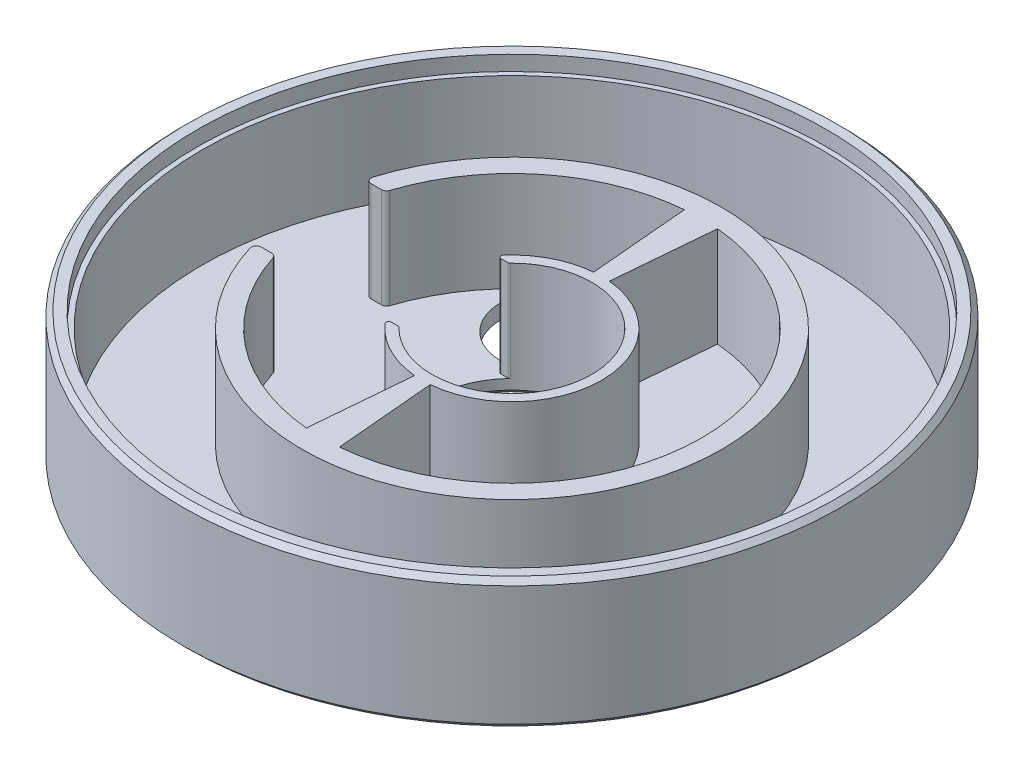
ISO-10303-21;
HEADER;
FILE_DESCRIPTION(('STEP AP214'),'2;1');
FILE_NAME('part.step','',(''),(''),'','','');
FILE_SCHEMA(('AUTOMOTIVE_DESIGN { 1 0 10303 214 1 1 1 1 }'));
ENDSEC;
DATA;
#1=APPLICATION_CONTEXT('core data for automotive mechanical design processes');
#2=APPLICATION_PROTOCOL_DEFINITION('international standard','automotive_design',2000,#1);
#3=PRODUCT_CONTEXT('',#1,'mechanical');
#4=PRODUCT('Part','Part','',(#3));
#5=PRODUCT_RELATED_PRODUCT_CATEGORY('part','',(#4));
#6=PRODUCT_DEFINITION_FORMATION('','',#4);
#7=PRODUCT_DEFINITION_CONTEXT('part definition',#1,'design');
#8=PRODUCT_DEFINITION('design','',#6,#7);
#9=PRODUCT_DEFINITION_SHAPE('','',#8);
#10=(LENGTH_UNIT() NAMED_UNIT(*) SI_UNIT(.MILLI.,.METRE.));
#11=(NAMED_UNIT(*) PLANE_ANGLE_UNIT() SI_UNIT($,.RADIAN.));
#12=(NAMED_UNIT(*) SI_UNIT($,.STERADIAN.) SOLID_ANGLE_UNIT());
#13=UNCERTAINTY_MEASURE_WITH_UNIT(LENGTH_MEASURE(1.E-05),#10,'distance_accuracy_value','');
#14=(GEOMETRIC_REPRESENTATION_CONTEXT(3) GLOBAL_UNCERTAINTY_ASSIGNED_CONTEXT((#13)) GLOBAL_UNIT_ASSIGNED_CONTEXT((#10,
#11,#12)) REPRESENTATION_CONTEXT('',''));
#15=CARTESIAN_POINT('',(0.,0.,0.));
#16=DIRECTION('',(0.,0.,1.));
#17=DIRECTION('',(1.,0.,0.));
#18=AXIS2_PLACEMENT_3D('',#15,#16,#17);
#19=CARTESIAN_POINT('',(-31.,-11.5,0.));
#20=DIRECTION('',(0.,1.,0.));
#21=DIRECTION('',(0.,0.,1.));
#22=AXIS2_PLACEMENT_3D('',#19,#20,#21);
#23=PLANE('',#22);
#24=CARTESIAN_POINT('',(-7.78490417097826,-11.5,-11.6359471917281));
#25=DIRECTION('',(0.,1.,0.));
#26=DIRECTION('',(0.,0.,1.));
#27=AXIS2_PLACEMENT_3D('',#24,#25,#26);
#28=CIRCLE('',#27,5.);
#29=CARTESIAN_POINT('',(-5.00458125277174,-11.5,-7.48025176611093));
#30=VERTEX_POINT('',#29);
#31=CARTESIAN_POINT('',(-10.5652270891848,-11.5,-15.7916426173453));
#32=VERTEX_POINT('',#31);
#33=EDGE_CURVE('E208',#30,#32,#28,.T.);
#34=ORIENTED_EDGE('',*,*,#33,.F.);
#35=CARTESIAN_POINT('',(0.,-11.5,0.));
#36=DIRECTION('',(0.,1.,0.));
#37=DIRECTION('',(0.,0.,1.));
#38=AXIS2_PLACEMENT_3D('',#35,#36,#37);
#39=CIRCLE('',#38,9.00000000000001);
#40=CARTESIAN_POINT('',(-0.784401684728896,-11.5,-8.96575228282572));
#41=VERTEX_POINT('',#40);
#42=EDGE_CURVE('E216',#41,#30,#39,.T.);
#43=ORIENTED_EDGE('',*,*,#42,.F.);
#44=DIRECTION('',(0.0871557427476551,0.,0.996194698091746));
#45=VECTOR('',#44,1.);
#46=CARTESIAN_POINT('',(-1.65595911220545,-11.5,-18.9276992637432));
#47=LINE('',#46,#45);
#48=CARTESIAN_POINT('',(-1.65595911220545,-11.5,-18.9276992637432));
#49=VERTEX_POINT('',#48);
#50=EDGE_CURVE('E246',#49,#41,#47,.T.);
#51=ORIENTED_EDGE('',*,*,#50,.F.);
#52=CARTESIAN_POINT('',(0.,-11.5,0.));
#53=DIRECTION('',(0.,1.,0.));
#54=DIRECTION('',(0.,0.,1.));
#55=AXIS2_PLACEMENT_3D('',#52,#53,#54);
#56=CIRCLE('',#55,19.);
#57=EDGE_CURVE('E219',#49,#32,#56,.T.);
#58=ORIENTED_EDGE('',*,*,#57,.T.);
#59=EDGE_LOOP('',(#34,#43,#51,#58));
#60=FACE_BOUND('',#59,.T.);
#61=ADVANCED_FACE('F34',(#60),#23,.T.);
#62=CARTESIAN_POINT('',(1.65595911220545,-11.5,18.9276992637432));
#63=DIRECTION('',(0.,-1.,0.));
#64=DIRECTION('',(0.,0.,1.));
#65=AXIS2_PLACEMENT_3D('',#62,#63,#64);
#66=PLANE('',#65);
#67=CARTESIAN_POINT('',(14.,-11.5,0.));
#68=DIRECTION('',(0.,1.,0.));
#69=DIRECTION('',(0.,0.,1.));
#70=AXIS2_PLACEMENT_3D('',#67,#68,#69);
#71=CIRCLE('',#70,5.);
#72=CARTESIAN_POINT('',(19.,-11.5,0.));
#73=VERTEX_POINT('',#72);
#74=CARTESIAN_POINT('',(9.00000000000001,-11.5,0.));
#75=VERTEX_POINT('',#74);
#76=EDGE_CURVE('E304',#73,#75,#71,.T.);
#77=ORIENTED_EDGE('',*,*,#76,.F.);
#78=CARTESIAN_POINT('',(0.,-11.5,0.));
#79=DIRECTION('',(0.,1.,0.));
#80=DIRECTION('',(0.,0.,-1.));
#81=AXIS2_PLACEMENT_3D('',#78,#79,#80);
#82=CIRCLE('',#81,19.);
#83=CARTESIAN_POINT('',(1.65595911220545,-11.5,-18.9276992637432));
#84=VERTEX_POINT('',#83);
#85=EDGE_CURVE('E263',#73,#84,#82,.T.);
#86=ORIENTED_EDGE('',*,*,#85,.T.);
#87=DIRECTION('',(-0.087155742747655,0.,0.996194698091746));
#88=VECTOR('',#87,1.);
#89=CARTESIAN_POINT('',(1.65595911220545,-11.5,-18.9276992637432));
#90=LINE('',#89,#88);
#91=CARTESIAN_POINT('',(0.784401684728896,-11.5,-8.96575228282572));
#92=VERTEX_POINT('',#91);
#93=EDGE_CURVE('E279',#84,#92,#90,.T.);
#94=ORIENTED_EDGE('',*,*,#93,.T.);
#95=CARTESIAN_POINT('',(0.,-11.5,0.));
#96=DIRECTION('',(0.,1.,0.));
#97=DIRECTION('',(0.,0.,-1.));
#98=AXIS2_PLACEMENT_3D('',#95,#96,#97);
#99=CIRCLE('',#98,9.00000000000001);
#100=EDGE_CURVE('E267',#75,#92,#99,.T.);
#101=ORIENTED_EDGE('',*,*,#100,.F.);
#102=EDGE_LOOP('',(#77,#86,#94,#101));
#103=FACE_BOUND('',#102,.T.);
#104=ADVANCED_FACE('F320',(#103),#66,.F.);
#105=EDGE_CURVE('E306',#75,#73,#71,.T.);
#106=ORIENTED_EDGE('',*,*,#105,.F.);
#107=CARTESIAN_POINT('',(0.784401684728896,-11.5,8.96575228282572));
#108=VERTEX_POINT('',#107);
#109=EDGE_CURVE('E264',#108,#75,#99,.T.);
#110=ORIENTED_EDGE('',*,*,#109,.F.);
#111=DIRECTION('',(-0.0871557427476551,0.,-0.996194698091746));
#112=VECTOR('',#111,1.);
#113=CARTESIAN_POINT('',(1.65595911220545,-11.5,18.9276992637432));
#114=LINE('',#113,#112);
#115=CARTESIAN_POINT('',(1.65595911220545,-11.5,18.9276992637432));
#116=VERTEX_POINT('',#115);
#117=EDGE_CURVE('E271',#116,#108,#114,.T.);
#118=ORIENTED_EDGE('',*,*,#117,.F.);
#119=EDGE_CURVE('E260',#116,#73,#82,.T.);
#120=ORIENTED_EDGE('',*,*,#119,.T.);
#121=EDGE_LOOP('',(#106,#110,#118,#120));
#122=FACE_BOUND('',#121,.T.);
#123=ADVANCED_FACE('F328',(#122),#66,.F.);
#124=CARTESIAN_POINT('',(0.,-13.,0.));
#125=DIRECTION('',(0.,1.,0.));
#126=DIRECTION('',(0.,0.,1.));
#127=AXIS2_PLACEMENT_3D('',#124,#125,#126);
#128=CYLINDRICAL_SURFACE('',#127,19.);
#129=CARTESIAN_POINT('',(-18.0782323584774,-11.5,5.84615384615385));
#130=VERTEX_POINT('',#129);
#131=CARTESIAN_POINT('',(-1.65595911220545,-11.5,18.9276992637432));
#132=VERTEX_POINT('',#131);
#133=EDGE_CURVE('E237',#130,#132,#56,.T.);
#134=ORIENTED_EDGE('',*,*,#133,.F.);
#135=DIRECTION('',(0.,1.,0.));
#136=VECTOR('',#135,1.);
#137=CARTESIAN_POINT('',(-18.0782323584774,-13.,5.84615384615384));
#138=LINE('',#137,#136);
#139=CARTESIAN_POINT('',(-18.0782323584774,-1.5,5.84615384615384));
#140=VERTEX_POINT('',#139);
#141=EDGE_CURVE('E419',#130,#140,#138,.T.);
#142=ORIENTED_EDGE('',*,*,#141,.T.);
#143=CARTESIAN_POINT('',(0.,-1.5,0.));
#144=DIRECTION('',(0.,1.,0.));
#145=DIRECTION('',(0.,0.,1.));
#146=AXIS2_PLACEMENT_3D('',#143,#144,#145);
#147=CIRCLE('',#146,19.);
#148=CARTESIAN_POINT('',(-1.65595911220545,-1.5,18.9276992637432));
#149=VERTEX_POINT('',#148);
#150=EDGE_CURVE('E463',#140,#149,#147,.T.);
#151=ORIENTED_EDGE('',*,*,#150,.T.);
#152=DIRECTION('',(0.,-1.,0.));
#153=VECTOR('',#152,1.);
#154=CARTESIAN_POINT('',(-1.65595911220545,0.,18.9276992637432));
#155=LINE('',#154,#153);
#156=EDGE_CURVE('E257',#149,#132,#155,.T.);
#157=ORIENTED_EDGE('',*,*,#156,.T.);
#158=EDGE_LOOP('',(#134,#142,#151,#157));
#159=FACE_BOUND('',#158,.T.);
#160=ADVANCED_FACE('F529',(#159),#128,.F.);
#161=CARTESIAN_POINT('',(0.,-13.,0.));
#162=DIRECTION('',(0.,1.,0.));
#163=DIRECTION('',(0.,0.,1.));
#164=AXIS2_PLACEMENT_3D('',#161,#162,#163);
#165=CYLINDRICAL_SURFACE('',#164,9.00000000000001);
#166=CARTESIAN_POINT('',(0.,-1.5,0.));
#167=DIRECTION('',(0.,1.,0.));
#168=DIRECTION('',(0.,0.,1.));
#169=AXIS2_PLACEMENT_3D('',#166,#167,#168);
#170=CIRCLE('',#169,9.00000000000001);
#171=CARTESIAN_POINT('',(-0.784401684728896,-1.5,8.96575228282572));
#172=VERTEX_POINT('',#171);
#173=CARTESIAN_POINT('',(-6.78389449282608,-1.5,5.91428571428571));
#174=VERTEX_POINT('',#173);
#175=EDGE_CURVE('E465',#172,#174,#170,.F.);
#176=ORIENTED_EDGE('',*,*,#175,.T.);
#177=DIRECTION('',(0.,1.,0.));
#178=VECTOR('',#177,1.);
#179=CARTESIAN_POINT('',(-6.78389449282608,-13.,5.91428571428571));
#180=LINE('',#179,#178);
#181=CARTESIAN_POINT('',(-6.78389449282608,-11.5,5.91428571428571));
#182=VERTEX_POINT('',#181);
#183=EDGE_CURVE('E384',#174,#182,#180,.F.);
#184=ORIENTED_EDGE('',*,*,#183,.T.);
#185=CARTESIAN_POINT('',(-0.784401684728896,-11.5,8.96575228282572));
#186=VERTEX_POINT('',#185);
#187=EDGE_CURVE('E231',#182,#186,#39,.T.);
#188=ORIENTED_EDGE('',*,*,#187,.T.);
#189=DIRECTION('',(0.,1.,0.));
#190=VECTOR('',#189,1.);
#191=CARTESIAN_POINT('',(-0.784401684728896,-11.5,8.96575228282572));
#192=LINE('',#191,#190);
#193=EDGE_CURVE('E253',#186,#172,#192,.T.);
#194=ORIENTED_EDGE('',*,*,#193,.T.);
#195=EDGE_LOOP('',(#176,#184,#188,#194));
#196=FACE_BOUND('',#195,.T.);
#197=ADVANCED_FACE('F519',(#196),#165,.T.);
#198=CARTESIAN_POINT('',(0.,-1.5,0.));
#199=DIRECTION('',(0.,1.,0.));
#200=DIRECTION('',(0.,0.,1.));
#201=AXIS2_PLACEMENT_3D('',#198,#199,#200);
#202=PLANE('',#201);
#203=DIRECTION('',(1.,0.,0.));
#204=VECTOR('',#203,1.);
#205=CARTESIAN_POINT('',(0.,-1.5,5.5));
#206=LINE('',#205,#204);
#207=CARTESIAN_POINT('',(-19.6022957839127,-1.5,5.5));
#208=VERTEX_POINT('',#207);
#209=CARTESIAN_POINT('',(-18.5539753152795,-1.5,5.5));
#210=VERTEX_POINT('',#209);
#211=EDGE_CURVE('E285',#208,#210,#206,.T.);
#212=ORIENTED_EDGE('',*,*,#211,.F.);
#213=CARTESIAN_POINT('',(-19.6022957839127,-1.5,6.));
#214=DIRECTION('',(0.,1.,0.));
#215=DIRECTION('',(0.,0.,1.));
#216=AXIS2_PLACEMENT_3D('',#213,#214,#215);
#217=CIRCLE('',#216,0.5);
#218=CARTESIAN_POINT('',(-20.08040055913,-1.5,6.14634146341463));
#219=VERTEX_POINT('',#218);
#220=EDGE_CURVE('E413',#208,#219,#217,.T.);
#221=ORIENTED_EDGE('',*,*,#220,.T.);
#222=CARTESIAN_POINT('',(0.,-1.5,0.));
#223=DIRECTION('',(0.,1.,0.));
#224=DIRECTION('',(0.,0.,1.));
#225=AXIS2_PLACEMENT_3D('',#222,#223,#224);
#226=CIRCLE('',#225,21.);
#227=CARTESIAN_POINT('',(-20.08040055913,-1.5,-6.14634146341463));
#228=VERTEX_POINT('',#227);
#229=EDGE_CURVE('E454',#219,#228,#226,.T.);
#230=ORIENTED_EDGE('',*,*,#229,.T.);
#231=CARTESIAN_POINT('',(-19.6022957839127,-1.5,-6.));
#232=DIRECTION('',(0.,1.,0.));
#233=DIRECTION('',(0.,0.,1.));
#234=AXIS2_PLACEMENT_3D('',#231,#232,#233);
#235=CIRCLE('',#234,0.5);
#236=CARTESIAN_POINT('',(-19.6022957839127,-1.5,-5.5));
#237=VERTEX_POINT('',#236);
#238=EDGE_CURVE('E409',#228,#237,#235,.T.);
#239=ORIENTED_EDGE('',*,*,#238,.T.);
#240=DIRECTION('',(-1.,0.,0.));
#241=VECTOR('',#240,1.);
#242=CARTESIAN_POINT('',(0.,-1.5,-5.5));
#243=LINE('',#242,#241);
#244=CARTESIAN_POINT('',(-18.5539753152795,-1.5,-5.5));
#245=VERTEX_POINT('',#244);
#246=EDGE_CURVE('E289',#245,#237,#243,.T.);
#247=ORIENTED_EDGE('',*,*,#246,.F.);
#248=CARTESIAN_POINT('',(-18.5539753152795,-1.5,-6.));
#249=DIRECTION('',(0.,1.,0.));
#250=DIRECTION('',(0.,0.,1.));
#251=AXIS2_PLACEMENT_3D('',#248,#249,#250);
#252=CIRCLE('',#251,0.5);
#253=CARTESIAN_POINT('',(-18.0782323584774,-1.5,-5.84615384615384));
#254=VERTEX_POINT('',#253);
#255=EDGE_CURVE('E407',#245,#254,#252,.T.);
#256=ORIENTED_EDGE('',*,*,#255,.T.);
#257=CARTESIAN_POINT('',(-1.65595911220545,-1.5,-18.9276992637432));
#258=VERTEX_POINT('',#257);
#259=EDGE_CURVE('E459',#258,#254,#147,.T.);
#260=ORIENTED_EDGE('',*,*,#259,.F.);
#261=DIRECTION('',(0.087155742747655,0.,0.996194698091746));
#262=VECTOR('',#261,1.);
#263=CARTESIAN_POINT('',(0.,-1.5,0.));
#264=LINE('',#263,#262);
#265=CARTESIAN_POINT('',(-0.784401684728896,-1.5,-8.96575228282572));
#266=VERTEX_POINT('',#265);
#267=EDGE_CURVE('E345',#258,#266,#264,.T.);
#268=ORIENTED_EDGE('',*,*,#267,.T.);
#269=CARTESIAN_POINT('',(-6.78389449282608,-1.5,-5.91428571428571));
#270=VERTEX_POINT('',#269);
#271=EDGE_CURVE('E469',#270,#266,#170,.F.);
#272=ORIENTED_EDGE('',*,*,#271,.F.);
#273=CARTESIAN_POINT('',(-6.59545297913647,-1.5,-5.75));
#274=DIRECTION('',(0.,1.,0.));
#275=DIRECTION('',(0.,0.,1.));
#276=AXIS2_PLACEMENT_3D('',#273,#274,#275);
#277=CIRCLE('',#276,0.25);
#278=CARTESIAN_POINT('',(-6.59545297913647,-1.5,-5.5));
#279=VERTEX_POINT('',#278);
#280=EDGE_CURVE('E372',#270,#279,#277,.T.);
#281=ORIENTED_EDGE('',*,*,#280,.T.);
#282=CARTESIAN_POINT('',(-5.91607978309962,-1.5,-5.5));
#283=VERTEX_POINT('',#282);
#284=EDGE_CURVE('E290',#283,#279,#243,.T.);
#285=ORIENTED_EDGE('',*,*,#284,.F.);
#286=CARTESIAN_POINT('',(-5.91607978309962,-1.5,-5.75));
#287=DIRECTION('',(0.,1.,0.));
#288=DIRECTION('',(0.,0.,1.));
#289=AXIS2_PLACEMENT_3D('',#286,#287,#288);
#290=CIRCLE('',#289,0.25);
#291=CARTESIAN_POINT('',(-5.7368046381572,-1.5,-5.57575757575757));
#292=VERTEX_POINT('',#291);
#293=EDGE_CURVE('E370',#283,#292,#290,.T.);
#294=ORIENTED_EDGE('',*,*,#293,.T.);
#295=CARTESIAN_POINT('',(0.,-1.5,0.));
#296=DIRECTION('',(0.,1.,0.));
#297=DIRECTION('',(0.,0.,1.));
#298=AXIS2_PLACEMENT_3D('',#295,#296,#297);
#299=CIRCLE('',#298,8.);
#300=CARTESIAN_POINT('',(-5.7368046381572,-1.5,5.57575757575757));
#301=VERTEX_POINT('',#300);
#302=EDGE_CURVE('E472',#292,#301,#299,.F.);
#303=ORIENTED_EDGE('',*,*,#302,.T.);
#304=CARTESIAN_POINT('',(-5.91607978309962,-1.5,5.75));
#305=DIRECTION('',(0.,1.,0.));
#306=DIRECTION('',(0.,0.,1.));
#307=AXIS2_PLACEMENT_3D('',#304,#305,#306);
#308=CIRCLE('',#307,0.25);
#309=CARTESIAN_POINT('',(-5.91607978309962,-1.5,5.5));
#310=VERTEX_POINT('',#309);
#311=EDGE_CURVE('E390',#301,#310,#308,.T.);
#312=ORIENTED_EDGE('',*,*,#311,.T.);
#313=CARTESIAN_POINT('',(-6.59545297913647,-1.5,5.5));
#314=VERTEX_POINT('',#313);
#315=EDGE_CURVE('E286',#314,#310,#206,.T.);
#316=ORIENTED_EDGE('',*,*,#315,.F.);
#317=CARTESIAN_POINT('',(-6.59545297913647,-1.5,5.75));
#318=DIRECTION('',(0.,1.,0.));
#319=DIRECTION('',(0.,0.,1.));
#320=AXIS2_PLACEMENT_3D('',#317,#318,#319);
#321=CIRCLE('',#320,0.25);
#322=EDGE_CURVE('E392',#314,#174,#321,.T.);
#323=ORIENTED_EDGE('',*,*,#322,.T.);
#324=ORIENTED_EDGE('',*,*,#175,.F.);
#325=DIRECTION('',(0.087155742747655,0.,-0.996194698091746));
#326=VECTOR('',#325,1.);
#327=CARTESIAN_POINT('',(0.,-1.5,0.));
#328=LINE('',#327,#326);
#329=EDGE_CURVE('E470',#149,#172,#328,.T.);
#330=ORIENTED_EDGE('',*,*,#329,.F.);
#331=ORIENTED_EDGE('',*,*,#150,.F.);
#332=CARTESIAN_POINT('',(-18.5539753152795,-1.5,6.));
#333=DIRECTION('',(0.,1.,0.));
#334=DIRECTION('',(0.,0.,1.));
#335=AXIS2_PLACEMENT_3D('',#332,#333,#334);
#336=CIRCLE('',#335,0.5);
#337=EDGE_CURVE('E411',#140,#210,#336,.T.);
#338=ORIENTED_EDGE('',*,*,#337,.T.);
#339=EDGE_LOOP('',(#212,#221,#230,#239,#247,#256,#260,#268,#272,#281,#285,#294,#303,#312,#316,
#323,#324,#330,#331,#338));
#340=FACE_BOUND('',#339,.T.);
#341=CARTESIAN_POINT('',(0.,-1.5,0.));
#342=DIRECTION('',(0.,1.,0.));
#343=DIRECTION('',(0.,0.,1.));
#344=AXIS2_PLACEMENT_3D('',#341,#342,#343);
#345=CIRCLE('',#344,19.);
#346=CARTESIAN_POINT('',(1.65595911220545,-1.5,18.9276992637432));
#347=VERTEX_POINT('',#346);
#348=CARTESIAN_POINT('',(1.65595911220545,-1.5,-18.9276992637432));
#349=VERTEX_POINT('',#348);
#350=EDGE_CURVE('E340',#347,#349,#345,.T.);
#351=ORIENTED_EDGE('',*,*,#350,.F.);
#352=DIRECTION('',(-0.087155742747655,0.,-0.996194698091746));
#353=VECTOR('',#352,1.);
#354=CARTESIAN_POINT('',(0.,-1.5,0.));
#355=LINE('',#354,#353);
#356=CARTESIAN_POINT('',(0.784401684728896,-1.5,8.96575228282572));
#357=VERTEX_POINT('',#356);
#358=EDGE_CURVE('E343',#347,#357,#355,.T.);
#359=ORIENTED_EDGE('',*,*,#358,.T.);
#360=CARTESIAN_POINT('',(0.,-1.5,0.));
#361=DIRECTION('',(0.,1.,0.));
#362=DIRECTION('',(0.,0.,1.));
#363=AXIS2_PLACEMENT_3D('',#360,#361,#362);
#364=CIRCLE('',#363,9.00000000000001);
#365=CARTESIAN_POINT('',(0.784401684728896,-1.5,-8.96575228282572));
#366=VERTEX_POINT('',#365);
#367=EDGE_CURVE('E336',#366,#357,#364,.F.);
#368=ORIENTED_EDGE('',*,*,#367,.F.);
#369=DIRECTION('',(-0.087155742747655,0.,0.996194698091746));
#370=VECTOR('',#369,1.);
#371=CARTESIAN_POINT('',(0.,-1.5,0.));
#372=LINE('',#371,#370);
#373=EDGE_CURVE('E341',#349,#366,#372,.T.);
#374=ORIENTED_EDGE('',*,*,#373,.F.);
#375=EDGE_LOOP('',(#351,#359,#368,#374));
#376=FACE_BOUND('',#375,.T.);
#377=ADVANCED_FACE('F452',(#340,#376),#202,.T.);
#378=CARTESIAN_POINT('',(0.,-1.5,0.));
#379=DIRECTION('',(0.,1.,0.));
#380=DIRECTION('',(0.,0.,1.));
#381=AXIS2_PLACEMENT_3D('',#378,#379,#380);
#382=CIRCLE('',#381,31.5);
#383=CARTESIAN_POINT('',(0.,-1.5,31.5));
#384=VERTEX_POINT('',#383);
#385=EDGE_CURVE('E480',#384,#384,#382,.T.);
#386=ORIENTED_EDGE('',*,*,#385,.T.);
#387=EDGE_LOOP('',(#386));
#388=FACE_BOUND('',#387,.T.);
#389=CARTESIAN_POINT('',(0.,-1.5,0.));
#390=DIRECTION('',(0.,1.,0.));
#391=DIRECTION('',(0.,0.,1.));
#392=AXIS2_PLACEMENT_3D('',#389,#390,#391);
#393=CIRCLE('',#392,31.);
#394=CARTESIAN_POINT('',(0.,-1.5,31.));
#395=VERTEX_POINT('',#394);
#396=EDGE_CURVE('E473',#395,#395,#393,.F.);
#397=ORIENTED_EDGE('',*,*,#396,.T.);
#398=EDGE_LOOP('',(#397));
#399=FACE_BOUND('',#398,.T.);
#400=ADVANCED_FACE('F575',(#388,#399),#202,.T.);
#401=CARTESIAN_POINT('',(0.,-13.,0.));
#402=DIRECTION('',(0.,1.,0.));
#403=DIRECTION('',(0.,0.,1.));
#404=AXIS2_PLACEMENT_3D('',#401,#402,#403);
#405=CYLINDRICAL_SURFACE('',#404,8.);
#406=CARTESIAN_POINT('',(0.,-12.5,0.));
#407=DIRECTION('',(0.,1.,0.));
#408=DIRECTION('',(0.,0.,1.));
#409=AXIS2_PLACEMENT_3D('',#406,#407,#408);
#410=CIRCLE('',#409,8.);
#411=CARTESIAN_POINT('',(0.,-12.5,8.));
#412=VERTEX_POINT('',#411);
#413=EDGE_CURVE('E365',#412,#412,#410,.F.);
#414=ORIENTED_EDGE('',*,*,#413,.T.);
#415=EDGE_LOOP('',(#414));
#416=FACE_BOUND('',#415,.T.);
#417=CARTESIAN_POINT('',(0.,-11.5,0.));
#418=DIRECTION('',(0.,-1.,0.));
#419=DIRECTION('',(0.,0.,-1.));
#420=AXIS2_PLACEMENT_3D('',#417,#418,#419);
#421=CIRCLE('',#420,8.);
#422=CARTESIAN_POINT('',(-5.7368046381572,-11.5,-5.57575757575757));
#423=VERTEX_POINT('',#422);
#424=CARTESIAN_POINT('',(-5.7368046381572,-11.5,5.57575757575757));
#425=VERTEX_POINT('',#424);
#426=EDGE_CURVE('E293',#423,#425,#421,.F.);
#427=ORIENTED_EDGE('',*,*,#426,.T.);
#428=DIRECTION('',(0.,1.,0.));
#429=VECTOR('',#428,1.);
#430=CARTESIAN_POINT('',(-5.7368046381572,-13.,5.57575757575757));
#431=LINE('',#430,#429);
#432=EDGE_CURVE('E394',#425,#301,#431,.T.);
#433=ORIENTED_EDGE('',*,*,#432,.T.);
#434=ORIENTED_EDGE('',*,*,#302,.F.);
#435=DIRECTION('',(0.,1.,0.));
#436=VECTOR('',#435,1.);
#437=CARTESIAN_POINT('',(-5.7368046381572,-13.,-5.57575757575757));
#438=LINE('',#437,#436);
#439=EDGE_CURVE('E378',#292,#423,#438,.F.);
#440=ORIENTED_EDGE('',*,*,#439,.T.);
#441=EDGE_LOOP('',(#427,#433,#434,#440));
#442=FACE_BOUND('',#441,.T.);
#443=ADVANCED_FACE('F502',(#416,#442),#405,.F.);
#444=CARTESIAN_POINT('',(0.,-13.,0.));
#445=DIRECTION('',(0.,1.,0.));
#446=DIRECTION('',(0.,0.,1.));
#447=AXIS2_PLACEMENT_3D('',#444,#445,#446);
#448=CYLINDRICAL_SURFACE('',#447,33.);
#449=CARTESIAN_POINT('',(0.,-12.5,0.));
#450=DIRECTION('',(0.,1.,0.));
#451=DIRECTION('',(0.,0.,1.));
#452=AXIS2_PLACEMENT_3D('',#449,#450,#451);
#453=CIRCLE('',#452,33.);
#454=CARTESIAN_POINT('',(0.,-12.5,33.));
#455=VERTEX_POINT('',#454);
#456=EDGE_CURVE('E353',#455,#455,#453,.T.);
#457=CARTESIAN_POINT('',(0.,-0.499999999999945,0.));
#458=DIRECTION('',(0.,1.,0.));
#459=DIRECTION('',(0.,0.,1.));
#460=AXIS2_PLACEMENT_3D('',#457,#458,#459);
#461=CIRCLE('',#460,33.);
#462=CARTESIAN_POINT('',(0.,-0.499999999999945,33.));
#463=VERTEX_POINT('',#462);
#464=EDGE_CURVE('E350',#463,#463,#461,.F.);
#465=CARTESIAN_POINT('',(0.,-12.5,33.));
#466=CARTESIAN_POINT('',(0.,-12.375,33.));
#467=CARTESIAN_POINT('',(0.,-12.25,33.));
#468=CARTESIAN_POINT('',(0.,-12.,33.));
#469=CARTESIAN_POINT('',(0.,-11.875,33.));
#470=CARTESIAN_POINT('',(0.,-11.625,33.));
#471=CARTESIAN_POINT('',(0.,-11.5,33.));
#472=CARTESIAN_POINT('',(0.,-11.25,33.));
#473=CARTESIAN_POINT('',(0.,-11.125,33.));
#474=CARTESIAN_POINT('',(0.,-10.875,33.));
#475=CARTESIAN_POINT('',(0.,-10.75,33.));
#476=CARTESIAN_POINT('',(0.,-10.5,33.));
#477=CARTESIAN_POINT('',(0.,-10.375,33.));
#478=CARTESIAN_POINT('',(0.,-10.125,33.));
#479=CARTESIAN_POINT('',(0.,-9.99999999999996,33.));
#480=CARTESIAN_POINT('',(0.,-9.74999999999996,33.));
#481=CARTESIAN_POINT('',(0.,-9.62499999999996,33.));
#482=CARTESIAN_POINT('',(0.,-9.37499999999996,33.));
#483=CARTESIAN_POINT('',(0.,-9.24999999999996,33.));
#484=CARTESIAN_POINT('',(0.,-8.99999999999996,33.));
#485=CARTESIAN_POINT('',(0.,-8.87499999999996,33.));
#486=CARTESIAN_POINT('',(0.,-8.62499999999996,33.));
#487=CARTESIAN_POINT('',(0.,-8.49999999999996,33.));
#488=CARTESIAN_POINT('',(0.,-8.24999999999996,33.));
#489=CARTESIAN_POINT('',(0.,-8.12499999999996,33.));
#490=CARTESIAN_POINT('',(0.,-7.87499999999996,33.));
#491=CARTESIAN_POINT('',(0.,-7.74999999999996,33.));
#492=CARTESIAN_POINT('',(0.,-7.49999999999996,33.));
#493=CARTESIAN_POINT('',(0.,-7.37499999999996,33.));
#494=CARTESIAN_POINT('',(0.,-7.12499999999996,33.));
#495=CARTESIAN_POINT('',(0.,-6.99999999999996,33.));
#496=CARTESIAN_POINT('',(0.,-6.74999999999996,33.));
#497=CARTESIAN_POINT('',(0.,-6.62499999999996,33.));
#498=CARTESIAN_POINT('',(0.,-6.37499999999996,33.));
#499=CARTESIAN_POINT('',(0.,-6.24999999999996,33.));
#500=CARTESIAN_POINT('',(0.,-5.99999999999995,33.));
#501=CARTESIAN_POINT('',(0.,-5.87499999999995,33.));
#502=CARTESIAN_POINT('',(0.,-5.62499999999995,33.));
#503=CARTESIAN_POINT('',(0.,-5.49999999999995,33.));
#504=CARTESIAN_POINT('',(0.,-5.24999999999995,33.));
#505=CARTESIAN_POINT('',(0.,-5.12499999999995,33.));
#506=CARTESIAN_POINT('',(0.,-4.87499999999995,33.));
#507=CARTESIAN_POINT('',(0.,-4.74999999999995,33.));
#508=CARTESIAN_POINT('',(0.,-4.49999999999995,33.));
#509=CARTESIAN_POINT('',(0.,-4.37499999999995,33.));
#510=CARTESIAN_POINT('',(0.,-4.12499999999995,33.));
#511=CARTESIAN_POINT('',(0.,-3.99999999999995,33.));
#512=CARTESIAN_POINT('',(0.,-3.74999999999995,33.));
#513=CARTESIAN_POINT('',(0.,-3.62499999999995,33.));
#514=CARTESIAN_POINT('',(0.,-3.37499999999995,33.));
#515=CARTESIAN_POINT('',(0.,-3.24999999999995,33.));
#516=CARTESIAN_POINT('',(0.,-2.99999999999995,33.));
#517=CARTESIAN_POINT('',(0.,-2.87499999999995,33.));
#518=CARTESIAN_POINT('',(0.,-2.62499999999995,33.));
#519=CARTESIAN_POINT('',(0.,-2.49999999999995,33.));
#520=CARTESIAN_POINT('',(0.,-2.24999999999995,33.));
#521=CARTESIAN_POINT('',(0.,-2.12499999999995,33.));
#522=CARTESIAN_POINT('',(0.,-1.87499999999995,33.));
#523=CARTESIAN_POINT('',(0.,-1.74999999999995,33.));
#524=CARTESIAN_POINT('',(0.,-1.49999999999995,33.));
#525=CARTESIAN_POINT('',(0.,-1.37499999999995,33.));
#526=CARTESIAN_POINT('',(0.,-1.12499999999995,33.));
#527=CARTESIAN_POINT('',(0.,-0.999999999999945,33.));
#528=CARTESIAN_POINT('',(0.,-0.749999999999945,33.));
#529=CARTESIAN_POINT('',(0.,-0.624999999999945,33.));
#530=CARTESIAN_POINT('',(0.,-0.499999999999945,33.));
#531=B_SPLINE_CURVE_WITH_KNOTS('',3,(#465,#466,#467,#468,#469,#470,#471,#472,#473,#474,#475,
#476,#477,#478,#479,#480,#481,#482,#483,#484,#485,#486,#487,#488,#489,#490,#491,#492,#493,#494,
#495,#496,#497,#498,#499,#500,#501,#502,#503,#504,#505,#506,#507,#508,#509,#510,#511,#512,#513,
#514,#515,#516,#517,#518,#519,#520,#521,#522,#523,#524,#525,#526,#527,#528,#529,#530),
.UNSPECIFIED.,.F.,.F.,(4,2,2,2,2,2,2,2,2,2,2,2,2,2,2,2,2,2,2,2,2,2,2,2,2,2,2,2,2,2,2,2,4),(0.,
0.375,0.750000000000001,1.125,1.5,1.875,2.25,2.625,3.,3.375,3.75,4.12500000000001,
4.50000000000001,4.87500000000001,5.25000000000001,5.62500000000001,6.00000000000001,
6.37500000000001,6.75000000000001,7.12500000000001,7.50000000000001,7.87500000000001,
8.25000000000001,8.62500000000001,9.00000000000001,9.37500000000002,9.75000000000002,10.125,
10.5,10.875,11.25,11.625,12.),.UNSPECIFIED.);
#532=EDGE_CURVE('BSEAM582',#455,#463,#531,.T.);
#533=ORIENTED_EDGE('',*,*,#456,.T.);
#534=ORIENTED_EDGE('',*,*,#464,.T.);
#535=ORIENTED_EDGE('',*,*,#532,.T.);
#536=ORIENTED_EDGE('',*,*,#532,.F.);
#537=EDGE_LOOP('',(#533,#535,#534,#536));
#538=FACE_BOUND('',#537,.T.);
#539=ADVANCED_FACE('F582',(#538),#448,.T.);
#540=CARTESIAN_POINT('',(0.,-13.,0.));
#541=DIRECTION('',(0.,1.,0.));
#542=DIRECTION('',(0.,0.,1.));
#543=AXIS2_PLACEMENT_3D('',#540,#541,#542);
#544=PLANE('',#543);
#545=CARTESIAN_POINT('',(0.,-13.,0.));
#546=DIRECTION('',(0.,1.,0.));
#547=DIRECTION('',(0.,0.,1.));
#548=AXIS2_PLACEMENT_3D('',#545,#546,#547);
#549=CIRCLE('',#548,8.49999999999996);
#550=CARTESIAN_POINT('',(0.,-13.,8.49999999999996));
#551=VERTEX_POINT('',#550);
#552=EDGE_CURVE('E362',#551,#551,#549,.T.);
#553=ORIENTED_EDGE('',*,*,#552,.T.);
#554=EDGE_LOOP('',(#553));
#555=FACE_BOUND('',#554,.T.);
#556=CARTESIAN_POINT('',(0.,-13.,0.));
#557=DIRECTION('',(0.,1.,0.));
#558=DIRECTION('',(0.,0.,1.));
#559=AXIS2_PLACEMENT_3D('',#556,#557,#558);
#560=CIRCLE('',#559,32.5);
#561=CARTESIAN_POINT('',(0.,-13.,32.5));
#562=VERTEX_POINT('',#561);
#563=EDGE_CURVE('E356',#562,#562,#560,.F.);
#564=ORIENTED_EDGE('',*,*,#563,.T.);
#565=EDGE_LOOP('',(#564));
#566=FACE_BOUND('',#565,.T.);
#567=CARTESIAN_POINT('',(-7.78490417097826,-13.,-11.6359471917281));
#568=DIRECTION('',(0.,1.,0.));
#569=DIRECTION('',(0.,0.,1.));
#570=AXIS2_PLACEMENT_3D('',#567,#568,#569);
#571=CIRCLE('',#570,5.);
#572=CARTESIAN_POINT('',(-7.78490417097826,-13.,-6.63594719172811));
#573=VERTEX_POINT('',#572);
#574=EDGE_CURVE('E220',#573,#573,#571,.T.);
#575=ORIENTED_EDGE('',*,*,#574,.T.);
#576=EDGE_LOOP('',(#575));
#577=FACE_BOUND('',#576,.T.);
#578=CARTESIAN_POINT('',(14.,-13.,0.));
#579=DIRECTION('',(0.,1.,0.));
#580=DIRECTION('',(0.,0.,1.));
#581=AXIS2_PLACEMENT_3D('',#578,#579,#580);
#582=CIRCLE('',#581,5.);
#583=CARTESIAN_POINT('',(14.,-13.,5.));
#584=VERTEX_POINT('',#583);
#585=EDGE_CURVE('E300',#584,#584,#582,.T.);
#586=ORIENTED_EDGE('',*,*,#585,.T.);
#587=EDGE_LOOP('',(#586));
#588=FACE_BOUND('',#587,.T.);
#589=ADVANCED_FACE('F579',(#555,#566,#577,#588),#544,.F.);
#590=CARTESIAN_POINT('',(0.,0.,0.));
#591=DIRECTION('',(0.,1.,0.));
#592=DIRECTION('',(0.,0.,1.));
#593=AXIS2_PLACEMENT_3D('',#590,#591,#592);
#594=PLANE('',#593);
#595=CARTESIAN_POINT('',(0.,0.,0.));
#596=DIRECTION('',(0.,1.,0.));
#597=DIRECTION('',(0.,0.,1.));
#598=AXIS2_PLACEMENT_3D('',#595,#596,#597);
#599=CIRCLE('',#598,32.5);
#600=CARTESIAN_POINT('',(0.,0.,32.5));
#601=VERTEX_POINT('',#600);
#602=EDGE_CURVE('E359',#601,#601,#599,.T.);
#603=ORIENTED_EDGE('',*,*,#602,.T.);
#604=EDGE_LOOP('',(#603));
#605=FACE_BOUND('',#604,.T.);
#606=CARTESIAN_POINT('',(0.,0.,0.));
#607=DIRECTION('',(0.,1.,0.));
#608=DIRECTION('',(0.,0.,1.));
#609=AXIS2_PLACEMENT_3D('',#606,#607,#608);
#610=CIRCLE('',#609,31.5);
#611=CARTESIAN_POINT('',(0.,0.,31.5));
#612=VERTEX_POINT('',#611);
#613=EDGE_CURVE('E476',#612,#612,#610,.T.);
#614=ORIENTED_EDGE('',*,*,#613,.F.);
#615=EDGE_LOOP('',(#614));
#616=FACE_BOUND('',#615,.T.);
#617=ADVANCED_FACE('F569',(#605,#616),#594,.T.);
#618=CARTESIAN_POINT('',(0.,-1.5,0.));
#619=DIRECTION('',(0.,1.,0.));
#620=DIRECTION('',(0.,0.,1.));
#621=AXIS2_PLACEMENT_3D('',#618,#619,#620);
#622=CYLINDRICAL_SURFACE('',#621,31.5);
#623=ORIENTED_EDGE('',*,*,#385,.F.);
#624=EDGE_LOOP('',(#623));
#625=FACE_BOUND('',#624,.T.);
#626=ORIENTED_EDGE('',*,*,#613,.T.);
#627=EDGE_LOOP('',(#626));
#628=FACE_BOUND('',#627,.T.);
#629=ADVANCED_FACE('F564',(#625,#628),#622,.F.);
#630=CARTESIAN_POINT('',(0.,-13.,0.));
#631=DIRECTION('',(0.,-1.,0.));
#632=DIRECTION('',(0.,0.,-1.));
#633=AXIS2_PLACEMENT_3D('',#630,#631,#632);
#634=CYLINDRICAL_SURFACE('',#633,31.);
#635=ORIENTED_EDGE('',*,*,#396,.F.);
#636=EDGE_LOOP('',(#635));
#637=FACE_BOUND('',#636,.T.);
#638=CARTESIAN_POINT('',(0.,-11.5,0.));
#639=DIRECTION('',(0.,-1.,0.));
#640=DIRECTION('',(0.,0.,-1.));
#641=AXIS2_PLACEMENT_3D('',#638,#639,#640);
#642=CIRCLE('',#641,31.);
#643=CARTESIAN_POINT('',(0.,-11.5,-31.));
#644=VERTEX_POINT('',#643);
#645=EDGE_CURVE('E444',#644,#644,#642,.T.);
#646=ORIENTED_EDGE('',*,*,#645,.T.);
#647=EDGE_LOOP('',(#646));
#648=FACE_BOUND('',#647,.T.);
#649=ADVANCED_FACE('F559',(#637,#648),#634,.F.);
#650=EDGE_CURVE('E205',#32,#30,#28,.T.);
#651=ORIENTED_EDGE('',*,*,#650,.F.);
#652=CARTESIAN_POINT('',(-18.0782323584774,-11.5,-5.84615384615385));
#653=VERTEX_POINT('',#652);
#654=EDGE_CURVE('E238',#32,#653,#56,.T.);
#655=ORIENTED_EDGE('',*,*,#654,.T.);
#656=CARTESIAN_POINT('',(-18.5539753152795,-11.5,-6.));
#657=DIRECTION('',(0.,1.,0.));
#658=DIRECTION('',(0.,0.,1.));
#659=AXIS2_PLACEMENT_3D('',#656,#657,#658);
#660=CIRCLE('',#659,0.5);
#661=CARTESIAN_POINT('',(-18.5539753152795,-11.5,-5.5));
#662=VERTEX_POINT('',#661);
#663=EDGE_CURVE('E11',#653,#662,#660,.F.);
#664=ORIENTED_EDGE('',*,*,#663,.T.);
#665=DIRECTION('',(1.,0.,0.));
#666=VECTOR('',#665,1.);
#667=CARTESIAN_POINT('',(-23.,-11.5,-5.5));
#668=LINE('',#667,#666);
#669=CARTESIAN_POINT('',(-19.6022957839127,-11.5,-5.5));
#670=VERTEX_POINT('',#669);
#671=EDGE_CURVE('E295',#670,#662,#668,.T.);
#672=ORIENTED_EDGE('',*,*,#671,.F.);
#673=CARTESIAN_POINT('',(-19.6022957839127,-11.5,-6.));
#674=DIRECTION('',(0.,1.,0.));
#675=DIRECTION('',(0.,0.,1.));
#676=AXIS2_PLACEMENT_3D('',#673,#674,#675);
#677=CIRCLE('',#676,0.5);
#678=CARTESIAN_POINT('',(-20.08040055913,-11.5,-6.14634146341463));
#679=VERTEX_POINT('',#678);
#680=EDGE_CURVE('E42',#670,#679,#677,.F.);
#681=ORIENTED_EDGE('',*,*,#680,.T.);
#682=CARTESIAN_POINT('',(0.,-11.5,0.));
#683=DIRECTION('',(0.,-1.,0.));
#684=DIRECTION('',(0.,0.,-1.));
#685=AXIS2_PLACEMENT_3D('',#682,#683,#684);
#686=CIRCLE('',#685,21.);
#687=CARTESIAN_POINT('',(-20.08040055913,-11.5,6.14634146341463));
#688=VERTEX_POINT('',#687);
#689=EDGE_CURVE('E434',#679,#688,#686,.T.);
#690=ORIENTED_EDGE('',*,*,#689,.T.);
#691=CARTESIAN_POINT('',(-19.6022957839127,-11.5,6.));
#692=DIRECTION('',(0.,1.,0.));
#693=DIRECTION('',(0.,0.,1.));
#694=AXIS2_PLACEMENT_3D('',#691,#692,#693);
#695=CIRCLE('',#694,0.5);
#696=CARTESIAN_POINT('',(-19.6022957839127,-11.5,5.5));
#697=VERTEX_POINT('',#696);
#698=EDGE_CURVE('E429',#688,#697,#695,.F.);
#699=ORIENTED_EDGE('',*,*,#698,.T.);
#700=DIRECTION('',(1.,0.,0.));
#701=VECTOR('',#700,1.);
#702=CARTESIAN_POINT('',(-23.,-11.5,5.5));
#703=LINE('',#702,#701);
#704=CARTESIAN_POINT('',(-18.5539753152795,-11.5,5.5));
#705=VERTEX_POINT('',#704);
#706=EDGE_CURVE('E299',#697,#705,#703,.T.);
#707=ORIENTED_EDGE('',*,*,#706,.T.);
#708=CARTESIAN_POINT('',(-18.5539753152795,-11.5,6.));
#709=DIRECTION('',(0.,1.,0.));
#710=DIRECTION('',(0.,0.,1.));
#711=AXIS2_PLACEMENT_3D('',#708,#709,#710);
#712=CIRCLE('',#711,0.5);
#713=EDGE_CURVE('E431',#705,#130,#712,.F.);
#714=ORIENTED_EDGE('',*,*,#713,.T.);
#715=ORIENTED_EDGE('',*,*,#133,.T.);
#716=DIRECTION('',(0.087155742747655,0.,-0.996194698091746));
#717=VECTOR('',#716,1.);
#718=CARTESIAN_POINT('',(-1.65595911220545,-11.5,18.9276992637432));
#719=LINE('',#718,#717);
#720=EDGE_CURVE('E255',#132,#186,#719,.T.);
#721=ORIENTED_EDGE('',*,*,#720,.T.);
#722=ORIENTED_EDGE('',*,*,#187,.F.);
#723=CARTESIAN_POINT('',(-6.59545297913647,-11.5,5.75));
#724=DIRECTION('',(0.,1.,0.));
#725=DIRECTION('',(0.,0.,1.));
#726=AXIS2_PLACEMENT_3D('',#723,#724,#725);
#727=CIRCLE('',#726,0.25);
#728=CARTESIAN_POINT('',(-6.59545297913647,-11.5,5.5));
#729=VERTEX_POINT('',#728);
#730=EDGE_CURVE('E397',#182,#729,#727,.F.);
#731=ORIENTED_EDGE('',*,*,#730,.T.);
#732=CARTESIAN_POINT('',(-5.91607978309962,-11.5,5.5));
#733=VERTEX_POINT('',#732);
#734=EDGE_CURVE('E296',#729,#733,#703,.T.);
#735=ORIENTED_EDGE('',*,*,#734,.T.);
#736=CARTESIAN_POINT('',(-5.91607978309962,-11.5,5.75));
#737=DIRECTION('',(0.,1.,0.));
#738=DIRECTION('',(0.,0.,1.));
#739=AXIS2_PLACEMENT_3D('',#736,#737,#738);
#740=CIRCLE('',#739,0.25);
#741=EDGE_CURVE('E399',#733,#425,#740,.F.);
#742=ORIENTED_EDGE('',*,*,#741,.T.);
#743=ORIENTED_EDGE('',*,*,#426,.F.);
#744=CARTESIAN_POINT('',(-5.91607978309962,-11.5,-5.75));
#745=DIRECTION('',(0.,1.,0.));
#746=DIRECTION('',(0.,0.,1.));
#747=AXIS2_PLACEMENT_3D('',#744,#745,#746);
#748=CIRCLE('',#747,0.25);
#749=CARTESIAN_POINT('',(-5.91607978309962,-11.5,-5.5));
#750=VERTEX_POINT('',#749);
#751=EDGE_CURVE('E382',#423,#750,#748,.F.);
#752=ORIENTED_EDGE('',*,*,#751,.T.);
#753=CARTESIAN_POINT('',(-6.59545297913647,-11.5,-5.5));
#754=VERTEX_POINT('',#753);
#755=EDGE_CURVE('E301',#754,#750,#668,.T.);
#756=ORIENTED_EDGE('',*,*,#755,.F.);
#757=CARTESIAN_POINT('',(-6.59545297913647,-11.5,-5.75));
#758=DIRECTION('',(0.,1.,0.));
#759=DIRECTION('',(0.,0.,1.));
#760=AXIS2_PLACEMENT_3D('',#757,#758,#759);
#761=CIRCLE('',#760,0.25);
#762=CARTESIAN_POINT('',(-6.78389449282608,-11.5,-5.91428571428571));
#763=VERTEX_POINT('',#762);
#764=EDGE_CURVE('E227',#754,#763,#761,.F.);
#765=ORIENTED_EDGE('',*,*,#764,.T.);
#766=EDGE_CURVE('E222',#30,#763,#39,.T.);
#767=ORIENTED_EDGE('',*,*,#766,.F.);
#768=EDGE_LOOP('',(#651,#655,#664,#672,#681,#690,#699,#707,#714,#715,#721,#722,#731,#735,#742,
#743,#752,#756,#765,#767));
#769=FACE_BOUND('',#768,.T.);
#770=ORIENTED_EDGE('',*,*,#645,.F.);
#771=EDGE_LOOP('',(#770));
#772=FACE_BOUND('',#771,.T.);
#773=ADVANCED_FACE('F223',(#769,#772),#23,.T.);
#774=CARTESIAN_POINT('',(0.,-13.,0.));
#775=DIRECTION('',(0.,-1.,0.));
#776=DIRECTION('',(0.,0.,-1.));
#777=AXIS2_PLACEMENT_3D('',#774,#775,#776);
#778=CYLINDRICAL_SURFACE('',#777,21.);
#779=ORIENTED_EDGE('',*,*,#229,.F.);
#780=DIRECTION('',(0.,-1.,0.));
#781=VECTOR('',#780,1.);
#782=CARTESIAN_POINT('',(-20.08040055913,-13.,6.14634146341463));
#783=LINE('',#782,#781);
#784=EDGE_CURVE('E417',#219,#688,#783,.T.);
#785=ORIENTED_EDGE('',*,*,#784,.T.);
#786=ORIENTED_EDGE('',*,*,#689,.F.);
#787=DIRECTION('',(0.,-1.,0.));
#788=VECTOR('',#787,1.);
#789=CARTESIAN_POINT('',(-20.08040055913,-13.,-6.14634146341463));
#790=LINE('',#789,#788);
#791=EDGE_CURVE('E415',#679,#228,#790,.F.);
#792=ORIENTED_EDGE('',*,*,#791,.T.);
#793=EDGE_LOOP('',(#779,#785,#786,#792));
#794=FACE_BOUND('',#793,.T.);
#795=ADVANCED_FACE('F441',(#794),#778,.T.);
#796=ORIENTED_EDGE('',*,*,#259,.T.);
#797=DIRECTION('',(0.,1.,0.));
#798=VECTOR('',#797,1.);
#799=CARTESIAN_POINT('',(-18.0782323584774,-13.,-5.84615384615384));
#800=LINE('',#799,#798);
#801=EDGE_CURVE('E427',#254,#653,#800,.F.);
#802=ORIENTED_EDGE('',*,*,#801,.T.);
#803=ORIENTED_EDGE('',*,*,#654,.F.);
#804=ORIENTED_EDGE('',*,*,#57,.F.);
#805=DIRECTION('',(0.,-1.,0.));
#806=VECTOR('',#805,1.);
#807=CARTESIAN_POINT('',(-1.65595911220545,0.,-18.9276992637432));
#808=LINE('',#807,#806);
#809=EDGE_CURVE('E249',#258,#49,#808,.T.);
#810=ORIENTED_EDGE('',*,*,#809,.F.);
#811=EDGE_LOOP('',(#796,#802,#803,#804,#810));
#812=FACE_BOUND('',#811,.T.);
#813=ADVANCED_FACE('F462',(#812),#128,.F.);
#814=ORIENTED_EDGE('',*,*,#766,.T.);
#815=DIRECTION('',(0.,1.,0.));
#816=VECTOR('',#815,1.);
#817=CARTESIAN_POINT('',(-6.78389449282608,-13.,-5.91428571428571));
#818=LINE('',#817,#816);
#819=EDGE_CURVE('E368',#763,#270,#818,.T.);
#820=ORIENTED_EDGE('',*,*,#819,.T.);
#821=ORIENTED_EDGE('',*,*,#271,.T.);
#822=DIRECTION('',(0.,1.,0.));
#823=VECTOR('',#822,1.);
#824=CARTESIAN_POINT('',(-0.784401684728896,-11.5,-8.96575228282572));
#825=LINE('',#824,#823);
#826=EDGE_CURVE('E236',#41,#266,#825,.T.);
#827=ORIENTED_EDGE('',*,*,#826,.F.);
#828=ORIENTED_EDGE('',*,*,#42,.T.);
#829=EDGE_LOOP('',(#814,#820,#821,#827,#828));
#830=FACE_BOUND('',#829,.T.);
#831=ADVANCED_FACE('F234',(#830),#165,.T.);
#832=CARTESIAN_POINT('',(0.,0.,0.));
#833=DIRECTION('',(-0.996194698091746,0.,0.0871557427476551));
#834=DIRECTION('',(0.0871557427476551,0.,0.996194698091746));
#835=AXIS2_PLACEMENT_3D('',#832,#833,#834);
#836=PLANE('',#835);
#837=ORIENTED_EDGE('',*,*,#809,.T.);
#838=ORIENTED_EDGE('',*,*,#50,.T.);
#839=ORIENTED_EDGE('',*,*,#826,.T.);
#840=ORIENTED_EDGE('',*,*,#267,.F.);
#841=EDGE_LOOP('',(#837,#838,#839,#840));
#842=FACE_BOUND('',#841,.T.);
#843=ADVANCED_FACE('F486',(#842),#836,.T.);
#844=CARTESIAN_POINT('',(0.,0.,0.));
#845=DIRECTION('',(0.996194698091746,0.,0.087155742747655));
#846=DIRECTION('',(0.087155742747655,0.,-0.996194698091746));
#847=AXIS2_PLACEMENT_3D('',#844,#845,#846);
#848=PLANE('',#847);
#849=ORIENTED_EDGE('',*,*,#329,.T.);
#850=ORIENTED_EDGE('',*,*,#193,.F.);
#851=ORIENTED_EDGE('',*,*,#720,.F.);
#852=ORIENTED_EDGE('',*,*,#156,.F.);
#853=EDGE_LOOP('',(#849,#850,#851,#852));
#854=FACE_BOUND('',#853,.T.);
#855=ADVANCED_FACE('F523',(#854),#848,.F.);
#856=CARTESIAN_POINT('',(0.,-13.,0.));
#857=DIRECTION('',(0.,1.,0.));
#858=DIRECTION('',(0.,0.,-1.));
#859=AXIS2_PLACEMENT_3D('',#856,#857,#858);
#860=CYLINDRICAL_SURFACE('',#859,19.);
#861=ORIENTED_EDGE('',*,*,#350,.T.);
#862=DIRECTION('',(0.,-1.,0.));
#863=VECTOR('',#862,1.);
#864=CARTESIAN_POINT('',(1.65595911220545,0.,-18.9276992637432));
#865=LINE('',#864,#863);
#866=EDGE_CURVE('E282',#349,#84,#865,.T.);
#867=ORIENTED_EDGE('',*,*,#866,.T.);
#868=ORIENTED_EDGE('',*,*,#85,.F.);
#869=ORIENTED_EDGE('',*,*,#119,.F.);
#870=DIRECTION('',(0.,-1.,0.));
#871=VECTOR('',#870,1.);
#872=CARTESIAN_POINT('',(1.65595911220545,0.,18.9276992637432));
#873=LINE('',#872,#871);
#874=EDGE_CURVE('E274',#347,#116,#873,.T.);
#875=ORIENTED_EDGE('',*,*,#874,.F.);
#876=EDGE_LOOP('',(#861,#867,#868,#869,#875));
#877=FACE_BOUND('',#876,.T.);
#878=ADVANCED_FACE('F324',(#877),#860,.F.);
#879=CARTESIAN_POINT('',(0.,-13.,0.));
#880=DIRECTION('',(0.,1.,0.));
#881=DIRECTION('',(0.,0.,-1.));
#882=AXIS2_PLACEMENT_3D('',#879,#880,#881);
#883=CYLINDRICAL_SURFACE('',#882,9.00000000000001);
#884=ORIENTED_EDGE('',*,*,#367,.T.);
#885=DIRECTION('',(0.,1.,0.));
#886=VECTOR('',#885,1.);
#887=CARTESIAN_POINT('',(0.784401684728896,-11.5,8.96575228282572));
#888=LINE('',#887,#886);
#889=EDGE_CURVE('E268',#108,#357,#888,.T.);
#890=ORIENTED_EDGE('',*,*,#889,.F.);
#891=ORIENTED_EDGE('',*,*,#109,.T.);
#892=ORIENTED_EDGE('',*,*,#100,.T.);
#893=DIRECTION('',(0.,1.,0.));
#894=VECTOR('',#893,1.);
#895=CARTESIAN_POINT('',(0.784401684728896,-11.5,-8.96575228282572));
#896=LINE('',#895,#894);
#897=EDGE_CURVE('E276',#92,#366,#896,.T.);
#898=ORIENTED_EDGE('',*,*,#897,.T.);
#899=EDGE_LOOP('',(#884,#890,#891,#892,#898));
#900=FACE_BOUND('',#899,.T.);
#901=ADVANCED_FACE('F334',(#900),#883,.T.);
#902=CARTESIAN_POINT('',(0.,0.,0.));
#903=DIRECTION('',(0.996194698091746,0.,-0.0871557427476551));
#904=DIRECTION('',(-0.0871557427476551,0.,-0.996194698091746));
#905=AXIS2_PLACEMENT_3D('',#902,#903,#904);
#906=PLANE('',#905);
#907=ORIENTED_EDGE('',*,*,#874,.T.);
#908=ORIENTED_EDGE('',*,*,#117,.T.);
#909=ORIENTED_EDGE('',*,*,#889,.T.);
#910=ORIENTED_EDGE('',*,*,#358,.F.);
#911=EDGE_LOOP('',(#907,#908,#909,#910));
#912=FACE_BOUND('',#911,.T.);
#913=ADVANCED_FACE('F331',(#912),#906,.T.);
#914=CARTESIAN_POINT('',(0.,0.,0.));
#915=DIRECTION('',(-0.996194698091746,0.,-0.087155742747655));
#916=DIRECTION('',(-0.087155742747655,0.,0.996194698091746));
#917=AXIS2_PLACEMENT_3D('',#914,#915,#916);
#918=PLANE('',#917);
#919=ORIENTED_EDGE('',*,*,#373,.T.);
#920=ORIENTED_EDGE('',*,*,#897,.F.);
#921=ORIENTED_EDGE('',*,*,#93,.F.);
#922=ORIENTED_EDGE('',*,*,#866,.F.);
#923=EDGE_LOOP('',(#919,#920,#921,#922));
#924=FACE_BOUND('',#923,.T.);
#925=ADVANCED_FACE('F773',(#924),#918,.F.);
#926=CARTESIAN_POINT('',(-23.,0.,-5.5));
#927=DIRECTION('',(0.,0.,-1.));
#928=DIRECTION('',(0.,1.,0.));
#929=AXIS2_PLACEMENT_3D('',#926,#927,#928);
#930=PLANE('',#929);
#931=ORIENTED_EDGE('',*,*,#284,.T.);
#932=DIRECTION('',(0.,1.,0.));
#933=VECTOR('',#932,1.);
#934=CARTESIAN_POINT('',(-6.59545297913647,0.,-5.5));
#935=LINE('',#934,#933);
#936=EDGE_CURVE('E376',#279,#754,#935,.F.);
#937=ORIENTED_EDGE('',*,*,#936,.T.);
#938=ORIENTED_EDGE('',*,*,#755,.T.);
#939=DIRECTION('',(0.,1.,0.));
#940=VECTOR('',#939,1.);
#941=CARTESIAN_POINT('',(-5.91607978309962,0.,-5.5));
#942=LINE('',#941,#940);
#943=EDGE_CURVE('E374',#750,#283,#942,.T.);
#944=ORIENTED_EDGE('',*,*,#943,.T.);
#945=EDGE_LOOP('',(#931,#937,#938,#944));
#946=FACE_BOUND('',#945,.T.);
#947=ADVANCED_FACE('F493',(#946),#930,.F.);
#948=CARTESIAN_POINT('',(-23.,0.,5.5));
#949=DIRECTION('',(0.,0.,1.));
#950=DIRECTION('',(0.,-1.,0.));
#951=AXIS2_PLACEMENT_3D('',#948,#949,#950);
#952=PLANE('',#951);
#953=ORIENTED_EDGE('',*,*,#734,.F.);
#954=DIRECTION('',(0.,1.,0.));
#955=VECTOR('',#954,1.);
#956=CARTESIAN_POINT('',(-6.59545297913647,0.,5.5));
#957=LINE('',#956,#955);
#958=EDGE_CURVE('E388',#729,#314,#957,.T.);
#959=ORIENTED_EDGE('',*,*,#958,.T.);
#960=ORIENTED_EDGE('',*,*,#315,.T.);
#961=DIRECTION('',(0.,1.,0.));
#962=VECTOR('',#961,1.);
#963=CARTESIAN_POINT('',(-5.91607978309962,0.,5.5));
#964=LINE('',#963,#962);
#965=EDGE_CURVE('E386',#310,#733,#964,.F.);
#966=ORIENTED_EDGE('',*,*,#965,.T.);
#967=EDGE_LOOP('',(#953,#959,#960,#966));
#968=FACE_BOUND('',#967,.T.);
#969=ADVANCED_FACE('F510',(#968),#952,.F.);
#970=ORIENTED_EDGE('',*,*,#706,.F.);
#971=DIRECTION('',(0.,1.,0.));
#972=VECTOR('',#971,1.);
#973=CARTESIAN_POINT('',(-19.6022957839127,-1.5,5.5));
#974=LINE('',#973,#972);
#975=EDGE_CURVE('E404',#697,#208,#974,.T.);
#976=ORIENTED_EDGE('',*,*,#975,.T.);
#977=ORIENTED_EDGE('',*,*,#211,.T.);
#978=DIRECTION('',(0.,1.,0.));
#979=VECTOR('',#978,1.);
#980=CARTESIAN_POINT('',(-18.5539753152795,0.,5.5));
#981=LINE('',#980,#979);
#982=EDGE_CURVE('E402',#210,#705,#981,.F.);
#983=ORIENTED_EDGE('',*,*,#982,.T.);
#984=EDGE_LOOP('',(#970,#976,#977,#983));
#985=FACE_BOUND('',#984,.T.);
#986=ADVANCED_FACE('F538',(#985),#952,.F.);
#987=ORIENTED_EDGE('',*,*,#246,.T.);
#988=DIRECTION('',(0.,1.,0.));
#989=VECTOR('',#988,1.);
#990=CARTESIAN_POINT('',(-19.6022957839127,-11.5,-5.5));
#991=LINE('',#990,#989);
#992=EDGE_CURVE('E424',#237,#670,#991,.F.);
#993=ORIENTED_EDGE('',*,*,#992,.T.);
#994=ORIENTED_EDGE('',*,*,#671,.T.);
#995=DIRECTION('',(0.,1.,0.));
#996=VECTOR('',#995,1.);
#997=CARTESIAN_POINT('',(-18.5539753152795,0.,-5.5));
#998=LINE('',#997,#996);
#999=EDGE_CURVE('E422',#662,#245,#998,.T.);
#1000=ORIENTED_EDGE('',*,*,#999,.T.);
#1001=EDGE_LOOP('',(#987,#993,#994,#1000));
#1002=FACE_BOUND('',#1001,.T.);
#1003=ADVANCED_FACE('F456',(#1002),#930,.F.);
#1004=CARTESIAN_POINT('',(14.,-13.,0.));
#1005=DIRECTION('',(0.,1.,0.));
#1006=DIRECTION('',(0.,0.,1.));
#1007=AXIS2_PLACEMENT_3D('',#1004,#1005,#1006);
#1008=CYLINDRICAL_SURFACE('',#1007,5.);
#1009=ORIENTED_EDGE('',*,*,#585,.F.);
#1010=EDGE_LOOP('',(#1009));
#1011=FACE_BOUND('',#1010,.T.);
#1012=ORIENTED_EDGE('',*,*,#76,.T.);
#1013=ORIENTED_EDGE('',*,*,#105,.T.);
#1014=EDGE_LOOP('',(#1012,#1013));
#1015=FACE_BOUND('',#1014,.T.);
#1016=ADVANCED_FACE('F315',(#1011,#1015),#1008,.F.);
#1017=CARTESIAN_POINT('',(-7.78490417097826,-13.,-11.6359471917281));
#1018=DIRECTION('',(0.,1.,0.));
#1019=DIRECTION('',(0.,0.,1.));
#1020=AXIS2_PLACEMENT_3D('',#1017,#1018,#1019);
#1021=CYLINDRICAL_SURFACE('',#1020,5.);
#1022=ORIENTED_EDGE('',*,*,#574,.F.);
#1023=EDGE_LOOP('',(#1022));
#1024=FACE_BOUND('',#1023,.T.);
#1025=ORIENTED_EDGE('',*,*,#33,.T.);
#1026=ORIENTED_EDGE('',*,*,#650,.T.);
#1027=EDGE_LOOP('',(#1025,#1026));
#1028=FACE_BOUND('',#1027,.T.);
#1029=ADVANCED_FACE('F207',(#1024,#1028),#1021,.F.);
#1030=CARTESIAN_POINT('',(0.,-12.5,0.));
#1031=DIRECTION('',(0.,1.,0.));
#1032=DIRECTION('',(0.,0.,1.));
#1033=AXIS2_PLACEMENT_3D('',#1030,#1031,#1032);
#1034=CONICAL_SURFACE('',#1033,33.,0.785398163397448);
#1035=ORIENTED_EDGE('',*,*,#563,.F.);
#1036=EDGE_LOOP('',(#1035));
#1037=FACE_BOUND('',#1036,.T.);
#1038=ORIENTED_EDGE('',*,*,#456,.F.);
#1039=EDGE_LOOP('',(#1038));
#1040=FACE_BOUND('',#1039,.T.);
#1041=ADVANCED_FACE('F593',(#1037,#1040),#1034,.T.);
#1042=CARTESIAN_POINT('',(0.,0.,0.));
#1043=DIRECTION('',(0.,-1.,0.));
#1044=DIRECTION('',(0.,0.,-1.));
#1045=AXIS2_PLACEMENT_3D('',#1042,#1043,#1044);
#1046=CONICAL_SURFACE('',#1045,32.5,0.785398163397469);
#1047=ORIENTED_EDGE('',*,*,#464,.F.);
#1048=EDGE_LOOP('',(#1047));
#1049=FACE_BOUND('',#1048,.T.);
#1050=ORIENTED_EDGE('',*,*,#602,.F.);
#1051=EDGE_LOOP('',(#1050));
#1052=FACE_BOUND('',#1051,.T.);
#1053=ADVANCED_FACE('F596',(#1049,#1052),#1046,.T.);
#1054=CARTESIAN_POINT('',(0.,-13.,0.));
#1055=DIRECTION('',(0.,-1.,0.));
#1056=DIRECTION('',(0.,0.,-1.));
#1057=AXIS2_PLACEMENT_3D('',#1054,#1055,#1056);
#1058=CONICAL_SURFACE('',#1057,8.49999999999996,0.785398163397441);
#1059=ORIENTED_EDGE('',*,*,#413,.F.);
#1060=EDGE_LOOP('',(#1059));
#1061=FACE_BOUND('',#1060,.T.);
#1062=ORIENTED_EDGE('',*,*,#552,.F.);
#1063=EDGE_LOOP('',(#1062));
#1064=FACE_BOUND('',#1063,.T.);
#1065=ADVANCED_FACE('F600',(#1061,#1064),#1058,.F.);
#1066=CARTESIAN_POINT('',(-6.59545297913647,-13.,-5.75));
#1067=DIRECTION('',(0.,1.,0.));
#1068=DIRECTION('',(0.,0.,1.));
#1069=AXIS2_PLACEMENT_3D('',#1066,#1067,#1068);
#1070=CYLINDRICAL_SURFACE('',#1069,0.25);
#1071=ORIENTED_EDGE('',*,*,#764,.F.);
#1072=ORIENTED_EDGE('',*,*,#936,.F.);
#1073=ORIENTED_EDGE('',*,*,#280,.F.);
#1074=ORIENTED_EDGE('',*,*,#819,.F.);
#1075=EDGE_LOOP('',(#1071,#1072,#1073,#1074));
#1076=FACE_BOUND('',#1075,.T.);
#1077=ADVANCED_FACE('F490',(#1076),#1070,.T.);
#1078=CARTESIAN_POINT('',(-5.91607978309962,-13.,-5.75));
#1079=DIRECTION('',(0.,1.,0.));
#1080=DIRECTION('',(0.,0.,1.));
#1081=AXIS2_PLACEMENT_3D('',#1078,#1079,#1080);
#1082=CYLINDRICAL_SURFACE('',#1081,0.25);
#1083=ORIENTED_EDGE('',*,*,#293,.F.);
#1084=ORIENTED_EDGE('',*,*,#943,.F.);
#1085=ORIENTED_EDGE('',*,*,#751,.F.);
#1086=ORIENTED_EDGE('',*,*,#439,.F.);
#1087=EDGE_LOOP('',(#1083,#1084,#1085,#1086));
#1088=FACE_BOUND('',#1087,.T.);
#1089=ADVANCED_FACE('F499',(#1088),#1082,.T.);
#1090=CARTESIAN_POINT('',(-6.59545297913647,-13.,5.75));
#1091=DIRECTION('',(0.,1.,0.));
#1092=DIRECTION('',(0.,0.,1.));
#1093=AXIS2_PLACEMENT_3D('',#1090,#1091,#1092);
#1094=CYLINDRICAL_SURFACE('',#1093,0.25);
#1095=ORIENTED_EDGE('',*,*,#322,.F.);
#1096=ORIENTED_EDGE('',*,*,#958,.F.);
#1097=ORIENTED_EDGE('',*,*,#730,.F.);
#1098=ORIENTED_EDGE('',*,*,#183,.F.);
#1099=EDGE_LOOP('',(#1095,#1096,#1097,#1098));
#1100=FACE_BOUND('',#1099,.T.);
#1101=ADVANCED_FACE('F515',(#1100),#1094,.T.);
#1102=CARTESIAN_POINT('',(-5.91607978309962,-13.,5.75));
#1103=DIRECTION('',(0.,1.,0.));
#1104=DIRECTION('',(0.,0.,1.));
#1105=AXIS2_PLACEMENT_3D('',#1102,#1103,#1104);
#1106=CYLINDRICAL_SURFACE('',#1105,0.25);
#1107=ORIENTED_EDGE('',*,*,#741,.F.);
#1108=ORIENTED_EDGE('',*,*,#965,.F.);
#1109=ORIENTED_EDGE('',*,*,#311,.F.);
#1110=ORIENTED_EDGE('',*,*,#432,.F.);
#1111=EDGE_LOOP('',(#1107,#1108,#1109,#1110));
#1112=FACE_BOUND('',#1111,.T.);
#1113=ADVANCED_FACE('F513',(#1112),#1106,.T.);
#1114=CARTESIAN_POINT('',(-19.6022957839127,-13.,6.));
#1115=DIRECTION('',(0.,-1.,0.));
#1116=DIRECTION('',(0.,0.,-1.));
#1117=AXIS2_PLACEMENT_3D('',#1114,#1115,#1116);
#1118=CYLINDRICAL_SURFACE('',#1117,0.5);
#1119=ORIENTED_EDGE('',*,*,#698,.F.);
#1120=ORIENTED_EDGE('',*,*,#784,.F.);
#1121=ORIENTED_EDGE('',*,*,#220,.F.);
#1122=ORIENTED_EDGE('',*,*,#975,.F.);
#1123=EDGE_LOOP('',(#1119,#1120,#1121,#1122));
#1124=FACE_BOUND('',#1123,.T.);
#1125=ADVANCED_FACE('F541',(#1124),#1118,.T.);
#1126=CARTESIAN_POINT('',(-18.5539753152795,-13.,6.));
#1127=DIRECTION('',(0.,1.,0.));
#1128=DIRECTION('',(0.,0.,1.));
#1129=AXIS2_PLACEMENT_3D('',#1126,#1127,#1128);
#1130=CYLINDRICAL_SURFACE('',#1129,0.5);
#1131=ORIENTED_EDGE('',*,*,#713,.F.);
#1132=ORIENTED_EDGE('',*,*,#982,.F.);
#1133=ORIENTED_EDGE('',*,*,#337,.F.);
#1134=ORIENTED_EDGE('',*,*,#141,.F.);
#1135=EDGE_LOOP('',(#1131,#1132,#1133,#1134));
#1136=FACE_BOUND('',#1135,.T.);
#1137=ADVANCED_FACE('F533',(#1136),#1130,.T.);
#1138=CARTESIAN_POINT('',(-19.6022957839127,-13.,-6.));
#1139=DIRECTION('',(0.,-1.,0.));
#1140=DIRECTION('',(0.,0.,-1.));
#1141=AXIS2_PLACEMENT_3D('',#1138,#1139,#1140);
#1142=CYLINDRICAL_SURFACE('',#1141,0.5);
#1143=ORIENTED_EDGE('',*,*,#238,.F.);
#1144=ORIENTED_EDGE('',*,*,#791,.F.);
#1145=ORIENTED_EDGE('',*,*,#680,.F.);
#1146=ORIENTED_EDGE('',*,*,#992,.F.);
#1147=EDGE_LOOP('',(#1143,#1144,#1145,#1146));
#1148=FACE_BOUND('',#1147,.T.);
#1149=ADVANCED_FACE('F447',(#1148),#1142,.T.);
#1150=CARTESIAN_POINT('',(-18.5539753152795,-13.,-6.));
#1151=DIRECTION('',(0.,1.,0.));
#1152=DIRECTION('',(0.,0.,1.));
#1153=AXIS2_PLACEMENT_3D('',#1150,#1151,#1152);
#1154=CYLINDRICAL_SURFACE('',#1153,0.5);
#1155=ORIENTED_EDGE('',*,*,#255,.F.);
#1156=ORIENTED_EDGE('',*,*,#999,.F.);
#1157=ORIENTED_EDGE('',*,*,#663,.F.);
#1158=ORIENTED_EDGE('',*,*,#801,.F.);
#1159=EDGE_LOOP('',(#1155,#1156,#1157,#1158));
#1160=FACE_BOUND('',#1159,.T.);
#1161=ADVANCED_FACE('F36',(#1160),#1154,.T.);
#1162=CLOSED_SHELL('',(#61,#104,#123,#160,#197,#377,#400,#443,#539,#589,#617,#629,#649,#773,
#795,#813,#831,#843,#855,#878,#901,#913,#925,#947,#969,#986,#1003,#1016,#1029,#1041,#1053,#1065,
#1077,#1089,#1101,#1113,#1125,#1137,#1149,#1161));
#1163=MANIFOLD_SOLID_BREP('B2',#1162);
#1164=ADVANCED_BREP_SHAPE_REPRESENTATION('',(#18,#1163),#14);
#1165=SHAPE_DEFINITION_REPRESENTATION(#9,#1164);
ENDSEC;
END-ISO-10303-21;
